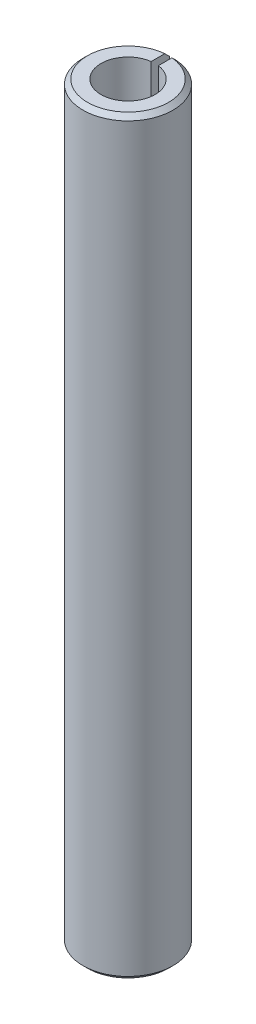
ISO-10303-21;
HEADER;
FILE_DESCRIPTION(('STEP AP214'),'2;1');
FILE_NAME('part.step','',(''),(''),'','','');
FILE_SCHEMA(('AUTOMOTIVE_DESIGN { 1 0 10303 214 1 1 1 1 }'));
ENDSEC;
DATA;
#1=APPLICATION_CONTEXT('core data for automotive mechanical design processes');
#2=APPLICATION_PROTOCOL_DEFINITION('international standard','automotive_design',2000,#1);
#3=PRODUCT_CONTEXT('',#1,'mechanical');
#4=PRODUCT('Part','Part','',(#3));
#5=PRODUCT_RELATED_PRODUCT_CATEGORY('part','',(#4));
#6=PRODUCT_DEFINITION_FORMATION('','',#4);
#7=PRODUCT_DEFINITION_CONTEXT('part definition',#1,'design');
#8=PRODUCT_DEFINITION('design','',#6,#7);
#9=PRODUCT_DEFINITION_SHAPE('','',#8);
#10=(LENGTH_UNIT() NAMED_UNIT(*) SI_UNIT(.MILLI.,.METRE.));
#11=(NAMED_UNIT(*) PLANE_ANGLE_UNIT() SI_UNIT($,.RADIAN.));
#12=(NAMED_UNIT(*) SI_UNIT($,.STERADIAN.) SOLID_ANGLE_UNIT());
#13=UNCERTAINTY_MEASURE_WITH_UNIT(LENGTH_MEASURE(1.E-05),#10,'distance_accuracy_value','');
#14=(GEOMETRIC_REPRESENTATION_CONTEXT(3) GLOBAL_UNCERTAINTY_ASSIGNED_CONTEXT((#13)) GLOBAL_UNIT_ASSIGNED_CONTEXT((#10,
#11,#12)) REPRESENTATION_CONTEXT('',''));
#15=CARTESIAN_POINT('',(0.,0.,0.));
#16=DIRECTION('',(0.,0.,1.));
#17=DIRECTION('',(1.,0.,0.));
#18=AXIS2_PLACEMENT_3D('',#15,#16,#17);
#19=CARTESIAN_POINT('',(-1.35,-12.5,0.));
#20=DIRECTION('',(0.,1.,0.));
#21=DIRECTION('',(0.,0.,1.));
#22=AXIS2_PLACEMENT_3D('',#19,#20,#21);
#23=PLANE('',#22);
#24=DIRECTION('',(0.,0.,1.));
#25=VECTOR('',#24,1.);
#26=CARTESIAN_POINT('',(-0.12,-12.5,-1.49519229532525));
#27=LINE('',#26,#25);
#28=CARTESIAN_POINT('',(-0.12,-12.5,-1.3446560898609));
#29=VERTEX_POINT('',#28);
#30=CARTESIAN_POINT('',(-0.12,-12.5,-0.891964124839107));
#31=VERTEX_POINT('',#30);
#32=EDGE_CURVE('E80',#29,#31,#27,.T.);
#33=ORIENTED_EDGE('',*,*,#32,.T.);
#34=CARTESIAN_POINT('',(0.,-12.5,0.));
#35=DIRECTION('',(0.,-1.,0.));
#36=DIRECTION('',(0.,0.,-1.));
#37=AXIS2_PLACEMENT_3D('',#34,#35,#36);
#38=CIRCLE('',#37,0.899999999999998);
#39=CARTESIAN_POINT('',(0.12,-12.5,-0.891964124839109));
#40=VERTEX_POINT('',#39);
#41=EDGE_CURVE('E91',#40,#31,#38,.T.);
#42=ORIENTED_EDGE('',*,*,#41,.F.);
#43=DIRECTION('',(0.,0.,-1.));
#44=VECTOR('',#43,1.);
#45=CARTESIAN_POINT('',(0.12,-12.5,-1.49519229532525));
#46=LINE('',#45,#44);
#47=CARTESIAN_POINT('',(0.12,-12.5,-1.3446560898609));
#48=VERTEX_POINT('',#47);
#49=EDGE_CURVE('E42',#40,#48,#46,.T.);
#50=ORIENTED_EDGE('',*,*,#49,.T.);
#51=CARTESIAN_POINT('',(0.,-12.5,0.));
#52=DIRECTION('',(0.,-1.,0.));
#53=DIRECTION('',(0.,0.,-1.));
#54=AXIS2_PLACEMENT_3D('',#51,#52,#53);
#55=CIRCLE('',#54,1.35);
#56=EDGE_CURVE('E11',#48,#29,#55,.T.);
#57=ORIENTED_EDGE('',*,*,#56,.T.);
#58=EDGE_LOOP('',(#33,#42,#50,#57));
#59=FACE_BOUND('',#58,.T.);
#60=ADVANCED_FACE('F28',(#59),#23,.F.);
#61=CARTESIAN_POINT('',(0.,-12.35,0.));
#62=DIRECTION('',(0.,1.,0.));
#63=DIRECTION('',(0.,0.,1.));
#64=AXIS2_PLACEMENT_3D('',#61,#62,#63);
#65=CONICAL_SURFACE('',#64,1.5,0.785398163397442);
#66=CARTESIAN_POINT('',(-0.12,-13.2526344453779,-0.585188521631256));
#67=CARTESIAN_POINT('',(-0.12,-13.2118143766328,-0.626844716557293));
#68=CARTESIAN_POINT('',(-0.12,-13.1709192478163,-0.668427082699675));
#69=CARTESIAN_POINT('',(-0.12,-13.0890247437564,-0.751488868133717));
#70=CARTESIAN_POINT('',(-0.12,-13.0480253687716,-0.792968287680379));
#71=CARTESIAN_POINT('',(-0.12,-12.9249396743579,-0.917319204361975));
#72=CARTESIAN_POINT('',(-0.12,-12.8427654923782,-1.000103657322));
#73=CARTESIAN_POINT('',(-0.12,-12.7046666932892,-1.13904541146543));
#74=CARTESIAN_POINT('',(-0.12,-12.64877131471,-1.19523180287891));
#75=CARTESIAN_POINT('',(-0.12,-12.5369458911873,-1.3075702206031));
#76=CARTESIAN_POINT('',(-0.12,-12.4810158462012,-1.36372224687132));
#77=CARTESIAN_POINT('',(-0.12,-12.2868015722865,-1.55863094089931));
#78=CARTESIAN_POINT('',(-0.12,-12.1484611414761,-1.69733159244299));
#79=CARTESIAN_POINT('',(-0.12,-11.8717103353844,-1.97466213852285));
#80=CARTESIAN_POINT('',(-0.12,-11.7332999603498,-2.1132920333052));
#81=CARTESIAN_POINT('',(-0.12,-11.5948863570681,-2.25191863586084));
#82=B_SPLINE_CURVE_WITH_KNOTS('',3,(#66,#67,#68,#69,#70,#71,#72,#73,#74,#75,#76,#77,#78,#79,#80,
#81),.UNSPECIFIED.,.F.,.F.,(4,2,2,2,2,2,2,4),(0.,0.174967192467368,0.349933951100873,
0.699866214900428,0.937628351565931,1.17539078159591,1.76308412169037,2.35077540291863),.UNSPECIFIED.);
#83=CARTESIAN_POINT('',(-0.12,-12.35,-1.49519229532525));
#84=VERTEX_POINT('',#83);
#85=EDGE_CURVE('E96',#29,#84,#82,.T.);
#86=ORIENTED_EDGE('',*,*,#85,.F.);
#87=ORIENTED_EDGE('',*,*,#56,.F.);
#88=CARTESIAN_POINT('',(0.12,-11.5948863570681,-2.25191863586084));
#89=CARTESIAN_POINT('',(0.12,-11.7333006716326,-2.1132918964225));
#90=CARTESIAN_POINT('',(0.12,-11.8717113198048,-1.97466144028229));
#91=CARTESIAN_POINT('',(0.12,-12.1484618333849,-1.69733061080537));
#92=CARTESIAN_POINT('',(0.12,-12.2868016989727,-1.55863023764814));
#93=CARTESIAN_POINT('',(0.12,-12.4942116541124,-1.35047954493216));
#94=CARTESIAN_POINT('',(0.12,-12.5633318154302,-1.28107914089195));
#95=CARTESIAN_POINT('',(0.12,-12.7015133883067,-1.14222003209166));
#96=CARTESIAN_POINT('',(0.12,-12.7705747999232,-1.07276132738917));
#97=CARTESIAN_POINT('',(0.12,-12.9086076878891,-0.933753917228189));
#98=CARTESIAN_POINT('',(0.12,-12.9775791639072,-0.864205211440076));
#99=CARTESIAN_POINT('',(0.12,-13.1153032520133,-0.724891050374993));
#100=CARTESIAN_POINT('',(0.12,-13.184055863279,-0.655125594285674));
#101=CARTESIAN_POINT('',(0.12,-13.2526344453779,-0.585188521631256));
#102=B_SPLINE_CURVE_WITH_KNOTS('',3,(#88,#89,#90,#91,#92,#93,#94,#95,#96,#97,#98,#99,#100,#101),
.UNSPECIFIED.,.F.,.F.,(4,2,2,2,2,2,4),(0.,0.587693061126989,1.17538462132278,1.46923167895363,
1.76307844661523,2.05692629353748,2.35077524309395),.UNSPECIFIED.);
#103=CARTESIAN_POINT('',(0.12,-12.35,-1.49519229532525));
#104=VERTEX_POINT('',#103);
#105=EDGE_CURVE('E117',#104,#48,#102,.T.);
#106=ORIENTED_EDGE('',*,*,#105,.F.);
#107=CARTESIAN_POINT('',(0.,-12.35,0.));
#108=DIRECTION('',(0.,-1.,0.));
#109=DIRECTION('',(0.,0.,-1.));
#110=AXIS2_PLACEMENT_3D('',#107,#108,#109);
#111=CIRCLE('',#110,1.5);
#112=EDGE_CURVE('E35',#104,#84,#111,.T.);
#113=ORIENTED_EDGE('',*,*,#112,.T.);
#114=EDGE_LOOP('',(#86,#87,#106,#113));
#115=FACE_BOUND('',#114,.T.);
#116=ADVANCED_FACE('F116',(#115),#65,.T.);
#117=CARTESIAN_POINT('',(0.,-12.5,0.));
#118=DIRECTION('',(0.,-1.,0.));
#119=DIRECTION('',(0.,0.,-1.));
#120=AXIS2_PLACEMENT_3D('',#117,#118,#119);
#121=CYLINDRICAL_SURFACE('',#120,1.5);
#122=DIRECTION('',(0.,-1.,0.));
#123=VECTOR('',#122,1.);
#124=CARTESIAN_POINT('',(-0.12,12.5,-1.49519229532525));
#125=LINE('',#124,#123);
#126=CARTESIAN_POINT('',(-0.12,12.35,-1.49519229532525));
#127=VERTEX_POINT('',#126);
#128=EDGE_CURVE('E86',#127,#84,#125,.T.);
#129=ORIENTED_EDGE('',*,*,#128,.T.);
#130=ORIENTED_EDGE('',*,*,#112,.F.);
#131=DIRECTION('',(0.,-1.,0.));
#132=VECTOR('',#131,1.);
#133=CARTESIAN_POINT('',(0.12,12.5,-1.49519229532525));
#134=LINE('',#133,#132);
#135=CARTESIAN_POINT('',(0.12,12.35,-1.49519229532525));
#136=VERTEX_POINT('',#135);
#137=EDGE_CURVE('E122',#136,#104,#134,.T.);
#138=ORIENTED_EDGE('',*,*,#137,.F.);
#139=CARTESIAN_POINT('',(0.,12.35,0.));
#140=DIRECTION('',(0.,-1.,0.));
#141=DIRECTION('',(0.,0.,-1.));
#142=AXIS2_PLACEMENT_3D('',#139,#140,#141);
#143=CIRCLE('',#142,1.5);
#144=EDGE_CURVE('E110',#136,#127,#143,.T.);
#145=ORIENTED_EDGE('',*,*,#144,.T.);
#146=EDGE_LOOP('',(#129,#130,#138,#145));
#147=FACE_BOUND('',#146,.T.);
#148=ADVANCED_FACE('F121',(#147),#121,.T.);
#149=CARTESIAN_POINT('',(0.,12.5,0.));
#150=DIRECTION('',(0.,-1.,0.));
#151=DIRECTION('',(0.,0.,-1.));
#152=AXIS2_PLACEMENT_3D('',#149,#150,#151);
#153=CONICAL_SURFACE('',#152,1.35,0.785398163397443);
#154=CARTESIAN_POINT('',(-0.12,11.5948863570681,-2.25191863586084));
#155=CARTESIAN_POINT('',(-0.12,11.7333006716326,-2.1132918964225));
#156=CARTESIAN_POINT('',(-0.12,11.8717113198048,-1.97466144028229));
#157=CARTESIAN_POINT('',(-0.12,12.1484618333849,-1.69733061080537));
#158=CARTESIAN_POINT('',(-0.12,12.2868016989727,-1.55863023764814));
#159=CARTESIAN_POINT('',(-0.12,12.4942116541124,-1.35047954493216));
#160=CARTESIAN_POINT('',(-0.12,12.5633318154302,-1.28107914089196));
#161=CARTESIAN_POINT('',(-0.12,12.7015133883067,-1.14222003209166));
#162=CARTESIAN_POINT('',(-0.12,12.7705747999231,-1.07276132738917));
#163=CARTESIAN_POINT('',(-0.12,12.9086076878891,-0.933753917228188));
#164=CARTESIAN_POINT('',(-0.12,12.9775791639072,-0.864205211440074));
#165=CARTESIAN_POINT('',(-0.12,13.1153032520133,-0.724891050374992));
#166=CARTESIAN_POINT('',(-0.12,13.184055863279,-0.655125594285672));
#167=CARTESIAN_POINT('',(-0.12,13.2526344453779,-0.585188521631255));
#168=B_SPLINE_CURVE_WITH_KNOTS('',3,(#154,#155,#156,#157,#158,#159,#160,#161,#162,#163,#164,
#165,#166,#167),.UNSPECIFIED.,.F.,.F.,(4,2,2,2,2,2,4),(0.,0.58769306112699,1.17538462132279,
1.46923167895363,1.76307844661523,2.05692629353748,2.35077524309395),.UNSPECIFIED.);
#169=CARTESIAN_POINT('',(-0.12,12.5,-1.3446560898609));
#170=VERTEX_POINT('',#169);
#171=EDGE_CURVE('E100',#127,#170,#168,.T.);
#172=ORIENTED_EDGE('',*,*,#171,.F.);
#173=ORIENTED_EDGE('',*,*,#144,.F.);
#174=CARTESIAN_POINT('',(0.12,13.2526344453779,-0.585188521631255));
#175=CARTESIAN_POINT('',(0.12,13.2118143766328,-0.626844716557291));
#176=CARTESIAN_POINT('',(0.12,13.1709192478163,-0.668427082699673));
#177=CARTESIAN_POINT('',(0.12,13.0890247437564,-0.751488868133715));
#178=CARTESIAN_POINT('',(0.12,13.0480253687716,-0.792968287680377));
#179=CARTESIAN_POINT('',(0.12,12.9249396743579,-0.917319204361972));
#180=CARTESIAN_POINT('',(0.12,12.8427654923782,-1.000103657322));
#181=CARTESIAN_POINT('',(0.12,12.7046666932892,-1.13904541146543));
#182=CARTESIAN_POINT('',(0.12,12.64877131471,-1.19523180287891));
#183=CARTESIAN_POINT('',(0.12,12.5369458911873,-1.3075702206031));
#184=CARTESIAN_POINT('',(0.12,12.4810158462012,-1.36372224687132));
#185=CARTESIAN_POINT('',(0.12,12.2868015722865,-1.55863094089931));
#186=CARTESIAN_POINT('',(0.12,12.1484611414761,-1.69733159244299));
#187=CARTESIAN_POINT('',(0.12,11.8717103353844,-1.97466213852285));
#188=CARTESIAN_POINT('',(0.12,11.7332999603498,-2.1132920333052));
#189=CARTESIAN_POINT('',(0.12,11.5948863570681,-2.25191863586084));
#190=B_SPLINE_CURVE_WITH_KNOTS('',3,(#174,#175,#176,#177,#178,#179,#180,#181,#182,#183,#184,
#185,#186,#187,#188,#189),.UNSPECIFIED.,.F.,.F.,(4,2,2,2,2,2,2,4),(0.,0.174967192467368,
0.349933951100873,0.699866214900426,0.937628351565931,1.17539078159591,1.76308412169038,
2.35077540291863),.UNSPECIFIED.);
#191=CARTESIAN_POINT('',(0.12,12.5,-1.3446560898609));
#192=VERTEX_POINT('',#191);
#193=EDGE_CURVE('E125',#192,#136,#190,.T.);
#194=ORIENTED_EDGE('',*,*,#193,.F.);
#195=CARTESIAN_POINT('',(0.,12.5,0.));
#196=DIRECTION('',(0.,-1.,0.));
#197=DIRECTION('',(0.,0.,-1.));
#198=AXIS2_PLACEMENT_3D('',#195,#196,#197);
#199=CIRCLE('',#198,1.35);
#200=EDGE_CURVE('E98',#192,#170,#199,.T.);
#201=ORIENTED_EDGE('',*,*,#200,.T.);
#202=EDGE_LOOP('',(#172,#173,#194,#201));
#203=FACE_BOUND('',#202,.T.);
#204=ADVANCED_FACE('F138',(#203),#153,.T.);
#205=CARTESIAN_POINT('',(-0.899999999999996,12.5,0.));
#206=DIRECTION('',(0.,-1.,0.));
#207=DIRECTION('',(0.,0.,-1.));
#208=AXIS2_PLACEMENT_3D('',#205,#206,#207);
#209=PLANE('',#208);
#210=DIRECTION('',(0.,0.,1.));
#211=VECTOR('',#210,1.);
#212=CARTESIAN_POINT('',(-0.12,12.5,-1.49519229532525));
#213=LINE('',#212,#211);
#214=CARTESIAN_POINT('',(-0.12,12.5,-0.891964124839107));
#215=VERTEX_POINT('',#214);
#216=EDGE_CURVE('E50',#170,#215,#213,.T.);
#217=ORIENTED_EDGE('',*,*,#216,.F.);
#218=ORIENTED_EDGE('',*,*,#200,.F.);
#219=DIRECTION('',(0.,0.,-1.));
#220=VECTOR('',#219,1.);
#221=CARTESIAN_POINT('',(0.12,12.5,-1.49519229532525));
#222=LINE('',#221,#220);
#223=CARTESIAN_POINT('',(0.12,12.5,-0.891964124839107));
#224=VERTEX_POINT('',#223);
#225=EDGE_CURVE('E154',#224,#192,#222,.T.);
#226=ORIENTED_EDGE('',*,*,#225,.F.);
#227=CARTESIAN_POINT('',(0.,12.5,0.));
#228=DIRECTION('',(0.,-1.,0.));
#229=DIRECTION('',(0.,0.,-1.));
#230=AXIS2_PLACEMENT_3D('',#227,#228,#229);
#231=CIRCLE('',#230,0.899999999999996);
#232=EDGE_CURVE('E95',#224,#215,#231,.T.);
#233=ORIENTED_EDGE('',*,*,#232,.T.);
#234=EDGE_LOOP('',(#217,#218,#226,#233));
#235=FACE_BOUND('',#234,.T.);
#236=ADVANCED_FACE('F163',(#235),#209,.F.);
#237=CARTESIAN_POINT('',(0.,-12.5,0.));
#238=DIRECTION('',(0.,-1.,0.));
#239=DIRECTION('',(0.,0.,-1.));
#240=AXIS2_PLACEMENT_3D('',#237,#238,#239);
#241=CYLINDRICAL_SURFACE('',#240,0.899999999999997);
#242=DIRECTION('',(0.,-1.,0.));
#243=VECTOR('',#242,1.);
#244=CARTESIAN_POINT('',(-0.12,12.5,-0.891964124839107));
#245=LINE('',#244,#243);
#246=EDGE_CURVE('E77',#215,#31,#245,.T.);
#247=ORIENTED_EDGE('',*,*,#246,.F.);
#248=ORIENTED_EDGE('',*,*,#232,.F.);
#249=DIRECTION('',(0.,-1.,0.));
#250=VECTOR('',#249,1.);
#251=CARTESIAN_POINT('',(0.12,12.5,-0.891964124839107));
#252=LINE('',#251,#250);
#253=EDGE_CURVE('E87',#224,#40,#252,.T.);
#254=ORIENTED_EDGE('',*,*,#253,.T.);
#255=ORIENTED_EDGE('',*,*,#41,.T.);
#256=EDGE_LOOP('',(#247,#248,#254,#255));
#257=FACE_BOUND('',#256,.T.);
#258=ADVANCED_FACE('F94',(#257),#241,.F.);
#259=CARTESIAN_POINT('',(0.12,12.5,-1.49519229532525));
#260=DIRECTION('',(-1.,0.,0.));
#261=DIRECTION('',(0.,0.,1.));
#262=AXIS2_PLACEMENT_3D('',#259,#260,#261);
#263=PLANE('',#262);
#264=ORIENTED_EDGE('',*,*,#105,.T.);
#265=ORIENTED_EDGE('',*,*,#49,.F.);
#266=ORIENTED_EDGE('',*,*,#253,.F.);
#267=ORIENTED_EDGE('',*,*,#225,.T.);
#268=ORIENTED_EDGE('',*,*,#193,.T.);
#269=ORIENTED_EDGE('',*,*,#137,.T.);
#270=EDGE_LOOP('',(#264,#265,#266,#267,#268,#269));
#271=FACE_BOUND('',#270,.T.);
#272=ADVANCED_FACE('F142',(#271),#263,.T.);
#273=CARTESIAN_POINT('',(-0.12,12.5,-1.49519229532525));
#274=DIRECTION('',(1.,0.,0.));
#275=DIRECTION('',(0.,0.,-1.));
#276=AXIS2_PLACEMENT_3D('',#273,#274,#275);
#277=PLANE('',#276);
#278=ORIENTED_EDGE('',*,*,#85,.T.);
#279=ORIENTED_EDGE('',*,*,#128,.F.);
#280=ORIENTED_EDGE('',*,*,#171,.T.);
#281=ORIENTED_EDGE('',*,*,#216,.T.);
#282=ORIENTED_EDGE('',*,*,#246,.T.);
#283=ORIENTED_EDGE('',*,*,#32,.F.);
#284=EDGE_LOOP('',(#278,#279,#280,#281,#282,#283));
#285=FACE_BOUND('',#284,.T.);
#286=ADVANCED_FACE('F79',(#285),#277,.T.);
#287=CLOSED_SHELL('',(#60,#116,#148,#204,#236,#258,#272,#286));
#288=MANIFOLD_SOLID_BREP('B2',#287);
#289=ADVANCED_BREP_SHAPE_REPRESENTATION('',(#18,#288),#14);
#290=SHAPE_DEFINITION_REPRESENTATION(#9,#289);
ENDSEC;
END-ISO-10303-21;
